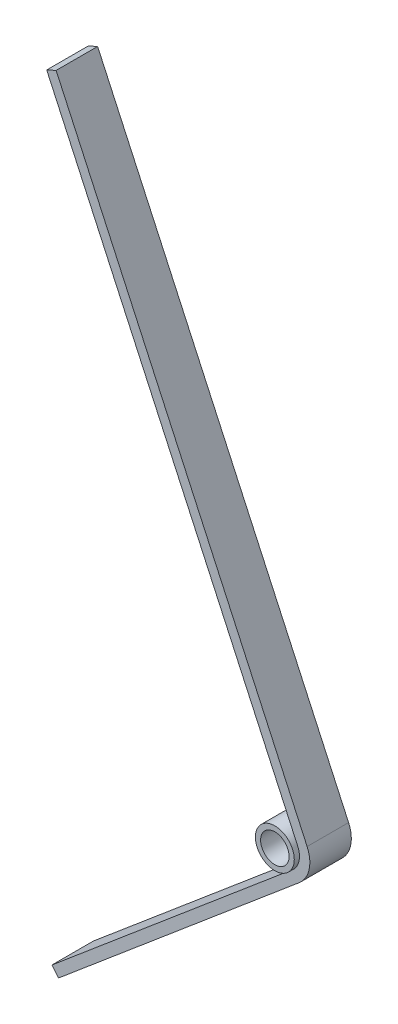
from build123d import *

# Parameters (mm, degrees)
SKETCH1_R           = 11.90625
SKETCH1_R_2         = 8.73125
EXTRUDE1_DEPTH      = 15.875
EXTRUDE_THIN1_DEPTH = 12.7


with BuildPart() as part:
    # Sketch1 → Extrude1 (new, symmetric)
    with BuildSketch(Plane.XY):
        Circle(SKETCH1_R)
        Circle(SKETCH1_R_2, mode=Mode.SUBTRACT)
    extrude(amount=EXTRUDE1_DEPTH, both=True)

    # Sketch2 → Extrude-Thin1 (add, symmetric)
    with BuildSketch(Plane.XY):
        with BuildLine():
            Line((-139.7, -133.35), (7.674384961, -9.1028899))
            ThreePointArc((7.674384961, -9.1028899), (11.619379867, -2.59784537), (10.820306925, 4.967871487))
            Line((10.820306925, 4.967871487), (-142.875, 339.725))
            Line((-142.875, 339.725), (-137.10416964, 342.37453146))
            Line((-137.10416964, 342.37453146), (16.591137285, 7.617402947))
            ThreePointArc((16.591137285, 7.617402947), (17.816382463, -3.983362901), (11.767390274, -13.957764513))
            Line((11.767390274, -13.957764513), (-135.606994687, -138.204874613))
            Line((-135.606994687, -138.204874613), (-139.7, -133.35))
        make_face()
    extrude(amount=EXTRUDE_THIN1_DEPTH, both=True)


solid = part.part
